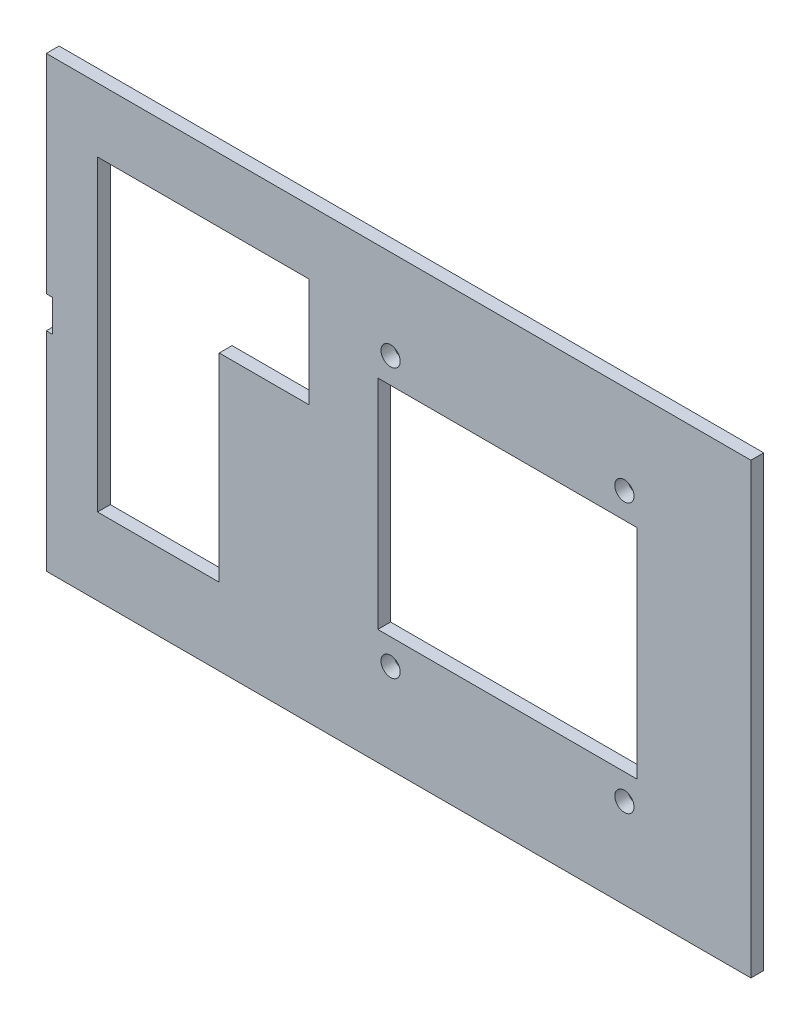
ISO-10303-21;
HEADER;
FILE_DESCRIPTION(('STEP AP214'),'2;1');
FILE_NAME('part.step','',(''),(''),'','','');
FILE_SCHEMA(('AUTOMOTIVE_DESIGN { 1 0 10303 214 1 1 1 1 }'));
ENDSEC;
DATA;
#1=APPLICATION_CONTEXT('core data for automotive mechanical design processes');
#2=APPLICATION_PROTOCOL_DEFINITION('international standard','automotive_design',2000,#1);
#3=PRODUCT_CONTEXT('',#1,'mechanical');
#4=PRODUCT('Part','Part','',(#3));
#5=PRODUCT_RELATED_PRODUCT_CATEGORY('part','',(#4));
#6=PRODUCT_DEFINITION_FORMATION('','',#4);
#7=PRODUCT_DEFINITION_CONTEXT('part definition',#1,'design');
#8=PRODUCT_DEFINITION('design','',#6,#7);
#9=PRODUCT_DEFINITION_SHAPE('','',#8);
#10=(LENGTH_UNIT() NAMED_UNIT(*) SI_UNIT(.MILLI.,.METRE.));
#11=(NAMED_UNIT(*) PLANE_ANGLE_UNIT() SI_UNIT($,.RADIAN.));
#12=(NAMED_UNIT(*) SI_UNIT($,.STERADIAN.) SOLID_ANGLE_UNIT());
#13=UNCERTAINTY_MEASURE_WITH_UNIT(LENGTH_MEASURE(1.E-05),#10,'distance_accuracy_value','');
#14=(GEOMETRIC_REPRESENTATION_CONTEXT(3) GLOBAL_UNCERTAINTY_ASSIGNED_CONTEXT((#13)) GLOBAL_UNIT_ASSIGNED_CONTEXT((#10,
#11,#12)) REPRESENTATION_CONTEXT('',''));
#15=CARTESIAN_POINT('',(0.,0.,0.));
#16=DIRECTION('',(0.,0.,1.));
#17=DIRECTION('',(1.,0.,0.));
#18=AXIS2_PLACEMENT_3D('',#15,#16,#17);
#19=CARTESIAN_POINT('',(0.,0.,2.));
#20=DIRECTION('',(0.,0.,1.));
#21=DIRECTION('',(1.,0.,0.));
#22=AXIS2_PLACEMENT_3D('',#19,#20,#21);
#23=PLANE('',#22);
#24=DIRECTION('',(0.,-1.,0.));
#25=VECTOR('',#24,1.);
#26=CARTESIAN_POINT('',(-47.,0.,2.));
#27=LINE('',#26,#25);
#28=CARTESIAN_POINT('',(-47.,25.,2.));
#29=VERTEX_POINT('',#28);
#30=CARTESIAN_POINT('',(-47.,-23.,2.));
#31=VERTEX_POINT('',#30);
#32=EDGE_CURVE('E186',#29,#31,#27,.T.);
#33=ORIENTED_EDGE('',*,*,#32,.F.);
#34=DIRECTION('',(-1.,0.,0.));
#35=VECTOR('',#34,1.);
#36=CARTESIAN_POINT('',(0.,25.,2.));
#37=LINE('',#36,#35);
#38=CARTESIAN_POINT('',(-14.,25.,2.));
#39=VERTEX_POINT('',#38);
#40=EDGE_CURVE('E184',#39,#29,#37,.T.);
#41=ORIENTED_EDGE('',*,*,#40,.F.);
#42=DIRECTION('',(0.,-1.,0.));
#43=VECTOR('',#42,1.);
#44=CARTESIAN_POINT('',(-14.,0.,2.));
#45=LINE('',#44,#43);
#46=CARTESIAN_POINT('',(-14.,7.99999999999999,2.));
#47=VERTEX_POINT('',#46);
#48=EDGE_CURVE('E179',#39,#47,#45,.T.);
#49=ORIENTED_EDGE('',*,*,#48,.T.);
#50=DIRECTION('',(-1.,0.,0.));
#51=VECTOR('',#50,1.);
#52=CARTESIAN_POINT('',(0.,7.99999999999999,2.));
#53=LINE('',#52,#51);
#54=CARTESIAN_POINT('',(-28.,7.99999999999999,2.));
#55=VERTEX_POINT('',#54);
#56=EDGE_CURVE('E177',#47,#55,#53,.T.);
#57=ORIENTED_EDGE('',*,*,#56,.T.);
#58=DIRECTION('',(0.,-1.,0.));
#59=VECTOR('',#58,1.);
#60=CARTESIAN_POINT('',(-28.,0.,2.));
#61=LINE('',#60,#59);
#62=CARTESIAN_POINT('',(-28.,-23.,2.));
#63=VERTEX_POINT('',#62);
#64=EDGE_CURVE('E162',#55,#63,#61,.T.);
#65=ORIENTED_EDGE('',*,*,#64,.T.);
#66=DIRECTION('',(-1.,0.,0.));
#67=VECTOR('',#66,1.);
#68=CARTESIAN_POINT('',(0.,-23.,2.));
#69=LINE('',#68,#67);
#70=EDGE_CURVE('E157',#63,#31,#69,.T.);
#71=ORIENTED_EDGE('',*,*,#70,.T.);
#72=EDGE_LOOP('',(#33,#41,#49,#57,#65,#71));
#73=FACE_BOUND('',#72,.T.);
#74=CARTESIAN_POINT('',(-1.25000000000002,21.,2.));
#75=DIRECTION('',(0.,0.,1.));
#76=DIRECTION('',(1.,0.,0.));
#77=AXIS2_PLACEMENT_3D('',#74,#75,#76);
#78=CIRCLE('',#77,1.5);
#79=CARTESIAN_POINT('',(0.249999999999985,21.,2.));
#80=VERTEX_POINT('',#79);
#81=EDGE_CURVE('E197',#80,#80,#78,.F.);
#82=ORIENTED_EDGE('',*,*,#81,.T.);
#83=EDGE_LOOP('',(#82));
#84=FACE_BOUND('',#83,.T.);
#85=CARTESIAN_POINT('',(35.25,-21.,2.));
#86=DIRECTION('',(0.,0.,1.));
#87=DIRECTION('',(1.,0.,0.));
#88=AXIS2_PLACEMENT_3D('',#85,#86,#87);
#89=CIRCLE('',#88,1.5);
#90=CARTESIAN_POINT('',(36.75,-21.,2.));
#91=VERTEX_POINT('',#90);
#92=EDGE_CURVE('E193',#91,#91,#89,.F.);
#93=ORIENTED_EDGE('',*,*,#92,.T.);
#94=EDGE_LOOP('',(#93));
#95=FACE_BOUND('',#94,.T.);
#96=CARTESIAN_POINT('',(-1.25000000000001,-21.,2.));
#97=DIRECTION('',(0.,0.,1.));
#98=DIRECTION('',(1.,0.,0.));
#99=AXIS2_PLACEMENT_3D('',#96,#97,#98);
#100=CIRCLE('',#99,1.5);
#101=CARTESIAN_POINT('',(0.249999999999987,-21.,2.));
#102=VERTEX_POINT('',#101);
#103=EDGE_CURVE('E189',#102,#102,#100,.F.);
#104=ORIENTED_EDGE('',*,*,#103,.T.);
#105=EDGE_LOOP('',(#104));
#106=FACE_BOUND('',#105,.T.);
#107=CARTESIAN_POINT('',(35.25,21.,2.));
#108=DIRECTION('',(0.,0.,1.));
#109=DIRECTION('',(1.,0.,0.));
#110=AXIS2_PLACEMENT_3D('',#107,#108,#109);
#111=CIRCLE('',#110,1.5);
#112=CARTESIAN_POINT('',(36.75,21.,2.));
#113=VERTEX_POINT('',#112);
#114=EDGE_CURVE('E201',#113,#113,#111,.F.);
#115=ORIENTED_EDGE('',*,*,#114,.T.);
#116=EDGE_LOOP('',(#115));
#117=FACE_BOUND('',#116,.T.);
#118=DIRECTION('',(0.,-1.,0.));
#119=VECTOR('',#118,1.);
#120=CARTESIAN_POINT('',(-55.,35.,2.));
#121=LINE('',#120,#119);
#122=CARTESIAN_POINT('',(-55.,35.,2.));
#123=VERTEX_POINT('',#122);
#124=CARTESIAN_POINT('',(-55.,2.5,2.));
#125=VERTEX_POINT('',#124);
#126=EDGE_CURVE('E253',#123,#125,#121,.T.);
#127=ORIENTED_EDGE('',*,*,#126,.T.);
#128=DIRECTION('',(1.,0.,0.));
#129=VECTOR('',#128,1.);
#130=CARTESIAN_POINT('',(0.,2.5,2.));
#131=LINE('',#130,#129);
#132=CARTESIAN_POINT('',(-54.,2.5,2.));
#133=VERTEX_POINT('',#132);
#134=EDGE_CURVE('E239',#125,#133,#131,.T.);
#135=ORIENTED_EDGE('',*,*,#134,.T.);
#136=DIRECTION('',(0.,-1.,0.));
#137=VECTOR('',#136,1.);
#138=CARTESIAN_POINT('',(-54.,0.,2.));
#139=LINE('',#138,#137);
#140=CARTESIAN_POINT('',(-54.,-2.5,2.));
#141=VERTEX_POINT('',#140);
#142=EDGE_CURVE('E242',#133,#141,#139,.T.);
#143=ORIENTED_EDGE('',*,*,#142,.T.);
#144=DIRECTION('',(-1.,0.,0.));
#145=VECTOR('',#144,1.);
#146=CARTESIAN_POINT('',(0.,-2.5,2.));
#147=LINE('',#146,#145);
#148=CARTESIAN_POINT('',(-55.,-2.5,2.));
#149=VERTEX_POINT('',#148);
#150=EDGE_CURVE('E234',#141,#149,#147,.T.);
#151=ORIENTED_EDGE('',*,*,#150,.T.);
#152=CARTESIAN_POINT('',(-55.,-35.,2.));
#153=VERTEX_POINT('',#152);
#154=EDGE_CURVE('E252',#149,#153,#121,.T.);
#155=ORIENTED_EDGE('',*,*,#154,.T.);
#156=DIRECTION('',(1.,0.,0.));
#157=VECTOR('',#156,1.);
#158=CARTESIAN_POINT('',(-55.,-35.,2.));
#159=LINE('',#158,#157);
#160=CARTESIAN_POINT('',(55.,-35.,2.));
#161=VERTEX_POINT('',#160);
#162=EDGE_CURVE('E256',#153,#161,#159,.T.);
#163=ORIENTED_EDGE('',*,*,#162,.T.);
#164=DIRECTION('',(0.,1.,0.));
#165=VECTOR('',#164,1.);
#166=CARTESIAN_POINT('',(55.,35.,2.));
#167=LINE('',#166,#165);
#168=CARTESIAN_POINT('',(55.,35.,2.));
#169=VERTEX_POINT('',#168);
#170=EDGE_CURVE('E246',#161,#169,#167,.T.);
#171=ORIENTED_EDGE('',*,*,#170,.T.);
#172=DIRECTION('',(-1.,0.,0.));
#173=VECTOR('',#172,1.);
#174=CARTESIAN_POINT('',(-55.,35.,2.));
#175=LINE('',#174,#173);
#176=EDGE_CURVE('E249',#169,#123,#175,.T.);
#177=ORIENTED_EDGE('',*,*,#176,.T.);
#178=EDGE_LOOP('',(#127,#135,#143,#151,#155,#163,#171,#177));
#179=FACE_BOUND('',#178,.T.);
#180=DIRECTION('',(1.,0.,0.));
#181=VECTOR('',#180,1.);
#182=CARTESIAN_POINT('',(0.,17.,2.));
#183=LINE('',#182,#181);
#184=CARTESIAN_POINT('',(-3.25000000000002,17.,2.));
#185=VERTEX_POINT('',#184);
#186=CARTESIAN_POINT('',(37.25,17.,2.));
#187=VERTEX_POINT('',#186);
#188=EDGE_CURVE('E221',#185,#187,#183,.T.);
#189=ORIENTED_EDGE('',*,*,#188,.T.);
#190=DIRECTION('',(0.,-1.,0.));
#191=VECTOR('',#190,1.);
#192=CARTESIAN_POINT('',(37.25,0.,2.));
#193=LINE('',#192,#191);
#194=CARTESIAN_POINT('',(37.25,-17.,2.));
#195=VERTEX_POINT('',#194);
#196=EDGE_CURVE('E224',#187,#195,#193,.T.);
#197=ORIENTED_EDGE('',*,*,#196,.T.);
#198=DIRECTION('',(-1.,0.,0.));
#199=VECTOR('',#198,1.);
#200=CARTESIAN_POINT('',(0.,-17.,2.));
#201=LINE('',#200,#199);
#202=CARTESIAN_POINT('',(-3.25000000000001,-17.,2.));
#203=VERTEX_POINT('',#202);
#204=EDGE_CURVE('E215',#195,#203,#201,.T.);
#205=ORIENTED_EDGE('',*,*,#204,.T.);
#206=DIRECTION('',(0.,1.,0.));
#207=VECTOR('',#206,1.);
#208=CARTESIAN_POINT('',(-3.25000000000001,0.,2.));
#209=LINE('',#208,#207);
#210=EDGE_CURVE('E218',#203,#185,#209,.T.);
#211=ORIENTED_EDGE('',*,*,#210,.T.);
#212=EDGE_LOOP('',(#189,#197,#205,#211));
#213=FACE_BOUND('',#212,.T.);
#214=ADVANCED_FACE('F35',(#73,#84,#95,#106,#117,#179,#213),#23,.T.);
#215=CARTESIAN_POINT('',(0.,0.,0.));
#216=DIRECTION('',(0.,0.,1.));
#217=DIRECTION('',(1.,0.,0.));
#218=AXIS2_PLACEMENT_3D('',#215,#216,#217);
#219=PLANE('',#218);
#220=DIRECTION('',(-1.,0.,0.));
#221=VECTOR('',#220,1.);
#222=CARTESIAN_POINT('',(0.,25.,0.));
#223=LINE('',#222,#221);
#224=CARTESIAN_POINT('',(-14.,25.,0.));
#225=VERTEX_POINT('',#224);
#226=CARTESIAN_POINT('',(-47.,25.,0.));
#227=VERTEX_POINT('',#226);
#228=EDGE_CURVE('E43',#225,#227,#223,.T.);
#229=ORIENTED_EDGE('',*,*,#228,.T.);
#230=DIRECTION('',(0.,-1.,0.));
#231=VECTOR('',#230,1.);
#232=CARTESIAN_POINT('',(-47.,0.,0.));
#233=LINE('',#232,#231);
#234=CARTESIAN_POINT('',(-47.,-23.,0.));
#235=VERTEX_POINT('',#234);
#236=EDGE_CURVE('E11',#227,#235,#233,.T.);
#237=ORIENTED_EDGE('',*,*,#236,.T.);
#238=DIRECTION('',(-1.,0.,0.));
#239=VECTOR('',#238,1.);
#240=CARTESIAN_POINT('',(0.,-23.,0.));
#241=LINE('',#240,#239);
#242=CARTESIAN_POINT('',(-28.,-23.,0.));
#243=VERTEX_POINT('',#242);
#244=EDGE_CURVE('E295',#243,#235,#241,.T.);
#245=ORIENTED_EDGE('',*,*,#244,.F.);
#246=DIRECTION('',(0.,-1.,0.));
#247=VECTOR('',#246,1.);
#248=CARTESIAN_POINT('',(-28.,0.,0.));
#249=LINE('',#248,#247);
#250=CARTESIAN_POINT('',(-28.,7.99999999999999,0.));
#251=VERTEX_POINT('',#250);
#252=EDGE_CURVE('E170',#251,#243,#249,.T.);
#253=ORIENTED_EDGE('',*,*,#252,.F.);
#254=DIRECTION('',(-1.,0.,0.));
#255=VECTOR('',#254,1.);
#256=CARTESIAN_POINT('',(0.,7.99999999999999,0.));
#257=LINE('',#256,#255);
#258=CARTESIAN_POINT('',(-14.,7.99999999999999,0.));
#259=VERTEX_POINT('',#258);
#260=EDGE_CURVE('E306',#259,#251,#257,.T.);
#261=ORIENTED_EDGE('',*,*,#260,.F.);
#262=DIRECTION('',(0.,-1.,0.));
#263=VECTOR('',#262,1.);
#264=CARTESIAN_POINT('',(-14.,0.,0.));
#265=LINE('',#264,#263);
#266=EDGE_CURVE('E308',#225,#259,#265,.T.);
#267=ORIENTED_EDGE('',*,*,#266,.F.);
#268=EDGE_LOOP('',(#229,#237,#245,#253,#261,#267));
#269=FACE_BOUND('',#268,.T.);
#270=CARTESIAN_POINT('',(-1.25000000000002,21.,0.));
#271=DIRECTION('',(0.,0.,1.));
#272=DIRECTION('',(1.,0.,0.));
#273=AXIS2_PLACEMENT_3D('',#270,#271,#272);
#274=CIRCLE('',#273,1.5);
#275=CARTESIAN_POINT('',(0.249999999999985,21.,0.));
#276=VERTEX_POINT('',#275);
#277=EDGE_CURVE('E196',#276,#276,#274,.F.);
#278=ORIENTED_EDGE('',*,*,#277,.F.);
#279=EDGE_LOOP('',(#278));
#280=FACE_BOUND('',#279,.T.);
#281=CARTESIAN_POINT('',(35.25,-21.,0.));
#282=DIRECTION('',(0.,0.,1.));
#283=DIRECTION('',(1.,0.,0.));
#284=AXIS2_PLACEMENT_3D('',#281,#282,#283);
#285=CIRCLE('',#284,1.5);
#286=CARTESIAN_POINT('',(36.75,-21.,0.));
#287=VERTEX_POINT('',#286);
#288=EDGE_CURVE('E192',#287,#287,#285,.F.);
#289=ORIENTED_EDGE('',*,*,#288,.F.);
#290=EDGE_LOOP('',(#289));
#291=FACE_BOUND('',#290,.T.);
#292=CARTESIAN_POINT('',(-1.25000000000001,-21.,0.));
#293=DIRECTION('',(0.,0.,1.));
#294=DIRECTION('',(1.,0.,0.));
#295=AXIS2_PLACEMENT_3D('',#292,#293,#294);
#296=CIRCLE('',#295,1.5);
#297=CARTESIAN_POINT('',(0.249999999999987,-21.,0.));
#298=VERTEX_POINT('',#297);
#299=EDGE_CURVE('E188',#298,#298,#296,.F.);
#300=ORIENTED_EDGE('',*,*,#299,.F.);
#301=EDGE_LOOP('',(#300));
#302=FACE_BOUND('',#301,.T.);
#303=CARTESIAN_POINT('',(35.25,21.,0.));
#304=DIRECTION('',(0.,0.,1.));
#305=DIRECTION('',(1.,0.,0.));
#306=AXIS2_PLACEMENT_3D('',#303,#304,#305);
#307=CIRCLE('',#306,1.5);
#308=CARTESIAN_POINT('',(36.75,21.,0.));
#309=VERTEX_POINT('',#308);
#310=EDGE_CURVE('E200',#309,#309,#307,.F.);
#311=ORIENTED_EDGE('',*,*,#310,.F.);
#312=EDGE_LOOP('',(#311));
#313=FACE_BOUND('',#312,.T.);
#314=DIRECTION('',(1.,0.,0.));
#315=VECTOR('',#314,1.);
#316=CARTESIAN_POINT('',(0.,2.5,0.));
#317=LINE('',#316,#315);
#318=CARTESIAN_POINT('',(-55.,2.5,0.));
#319=VERTEX_POINT('',#318);
#320=CARTESIAN_POINT('',(-54.,2.5,0.));
#321=VERTEX_POINT('',#320);
#322=EDGE_CURVE('E284',#319,#321,#317,.T.);
#323=ORIENTED_EDGE('',*,*,#322,.F.);
#324=DIRECTION('',(0.,-1.,0.));
#325=VECTOR('',#324,1.);
#326=CARTESIAN_POINT('',(-55.,35.,0.));
#327=LINE('',#326,#325);
#328=CARTESIAN_POINT('',(-55.,35.,0.));
#329=VERTEX_POINT('',#328);
#330=EDGE_CURVE('E264',#329,#319,#327,.T.);
#331=ORIENTED_EDGE('',*,*,#330,.F.);
#332=DIRECTION('',(-1.,0.,0.));
#333=VECTOR('',#332,1.);
#334=CARTESIAN_POINT('',(-55.,35.,0.));
#335=LINE('',#334,#333);
#336=CARTESIAN_POINT('',(55.,35.,0.));
#337=VERTEX_POINT('',#336);
#338=EDGE_CURVE('E261',#337,#329,#335,.T.);
#339=ORIENTED_EDGE('',*,*,#338,.F.);
#340=DIRECTION('',(0.,1.,0.));
#341=VECTOR('',#340,1.);
#342=CARTESIAN_POINT('',(55.,35.,0.));
#343=LINE('',#342,#341);
#344=CARTESIAN_POINT('',(55.,-35.,0.));
#345=VERTEX_POINT('',#344);
#346=EDGE_CURVE('E245',#345,#337,#343,.T.);
#347=ORIENTED_EDGE('',*,*,#346,.F.);
#348=DIRECTION('',(1.,0.,0.));
#349=VECTOR('',#348,1.);
#350=CARTESIAN_POINT('',(-55.,-35.,0.));
#351=LINE('',#350,#349);
#352=CARTESIAN_POINT('',(-55.,-35.,0.));
#353=VERTEX_POINT('',#352);
#354=EDGE_CURVE('E250',#353,#345,#351,.T.);
#355=ORIENTED_EDGE('',*,*,#354,.F.);
#356=CARTESIAN_POINT('',(-55.,-2.5,0.));
#357=VERTEX_POINT('',#356);
#358=EDGE_CURVE('E263',#357,#353,#327,.T.);
#359=ORIENTED_EDGE('',*,*,#358,.F.);
#360=DIRECTION('',(-1.,0.,0.));
#361=VECTOR('',#360,1.);
#362=CARTESIAN_POINT('',(0.,-2.5,0.));
#363=LINE('',#362,#361);
#364=CARTESIAN_POINT('',(-54.,-2.5,0.));
#365=VERTEX_POINT('',#364);
#366=EDGE_CURVE('E279',#365,#357,#363,.T.);
#367=ORIENTED_EDGE('',*,*,#366,.F.);
#368=DIRECTION('',(0.,-1.,0.));
#369=VECTOR('',#368,1.);
#370=CARTESIAN_POINT('',(-54.,0.,0.));
#371=LINE('',#370,#369);
#372=EDGE_CURVE('E281',#321,#365,#371,.T.);
#373=ORIENTED_EDGE('',*,*,#372,.F.);
#374=EDGE_LOOP('',(#323,#331,#339,#347,#355,#359,#367,#373));
#375=FACE_BOUND('',#374,.T.);
#376=DIRECTION('',(0.,-1.,0.));
#377=VECTOR('',#376,1.);
#378=CARTESIAN_POINT('',(37.25,0.,0.));
#379=LINE('',#378,#377);
#380=CARTESIAN_POINT('',(37.25,17.,0.));
#381=VERTEX_POINT('',#380);
#382=CARTESIAN_POINT('',(37.25,-17.,0.));
#383=VERTEX_POINT('',#382);
#384=EDGE_CURVE('E292',#381,#383,#379,.T.);
#385=ORIENTED_EDGE('',*,*,#384,.F.);
#386=DIRECTION('',(1.,0.,0.));
#387=VECTOR('',#386,1.);
#388=CARTESIAN_POINT('',(0.,17.,0.));
#389=LINE('',#388,#387);
#390=CARTESIAN_POINT('',(-3.25000000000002,17.,0.));
#391=VERTEX_POINT('',#390);
#392=EDGE_CURVE('E290',#391,#381,#389,.T.);
#393=ORIENTED_EDGE('',*,*,#392,.F.);
#394=DIRECTION('',(0.,1.,0.));
#395=VECTOR('',#394,1.);
#396=CARTESIAN_POINT('',(-3.25000000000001,0.,0.));
#397=LINE('',#396,#395);
#398=CARTESIAN_POINT('',(-3.25000000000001,-17.,0.));
#399=VERTEX_POINT('',#398);
#400=EDGE_CURVE('E288',#399,#391,#397,.T.);
#401=ORIENTED_EDGE('',*,*,#400,.F.);
#402=DIRECTION('',(-1.,0.,0.));
#403=VECTOR('',#402,1.);
#404=CARTESIAN_POINT('',(0.,-17.,0.));
#405=LINE('',#404,#403);
#406=EDGE_CURVE('E286',#383,#399,#405,.T.);
#407=ORIENTED_EDGE('',*,*,#406,.F.);
#408=EDGE_LOOP('',(#385,#393,#401,#407));
#409=FACE_BOUND('',#408,.T.);
#410=ADVANCED_FACE('F312',(#269,#280,#291,#302,#313,#375,#409),#219,.F.);
#411=CARTESIAN_POINT('',(-55.,35.,2.));
#412=DIRECTION('',(1.,0.,0.));
#413=DIRECTION('',(0.,0.,-1.));
#414=AXIS2_PLACEMENT_3D('',#411,#412,#413);
#415=PLANE('',#414);
#416=DIRECTION('',(0.,0.,-1.));
#417=VECTOR('',#416,1.);
#418=CARTESIAN_POINT('',(-55.,2.5,2.));
#419=LINE('',#418,#417);
#420=EDGE_CURVE('E237',#125,#319,#419,.T.);
#421=ORIENTED_EDGE('',*,*,#420,.F.);
#422=ORIENTED_EDGE('',*,*,#126,.F.);
#423=DIRECTION('',(0.,0.,-1.));
#424=VECTOR('',#423,1.);
#425=CARTESIAN_POINT('',(-55.,35.,2.));
#426=LINE('',#425,#424);
#427=EDGE_CURVE('E273',#123,#329,#426,.T.);
#428=ORIENTED_EDGE('',*,*,#427,.T.);
#429=ORIENTED_EDGE('',*,*,#330,.T.);
#430=EDGE_LOOP('',(#421,#422,#428,#429));
#431=FACE_BOUND('',#430,.T.);
#432=ADVANCED_FACE('F352',(#431),#415,.F.);
#433=DIRECTION('',(0.,0.,1.));
#434=VECTOR('',#433,1.);
#435=CARTESIAN_POINT('',(-55.,-2.5,2.));
#436=LINE('',#435,#434);
#437=EDGE_CURVE('E232',#357,#149,#436,.T.);
#438=ORIENTED_EDGE('',*,*,#437,.F.);
#439=ORIENTED_EDGE('',*,*,#358,.T.);
#440=DIRECTION('',(0.,0.,-1.));
#441=VECTOR('',#440,1.);
#442=CARTESIAN_POINT('',(-55.,-35.,2.));
#443=LINE('',#442,#441);
#444=EDGE_CURVE('E270',#153,#353,#443,.T.);
#445=ORIENTED_EDGE('',*,*,#444,.F.);
#446=ORIENTED_EDGE('',*,*,#154,.F.);
#447=EDGE_LOOP('',(#438,#439,#445,#446));
#448=FACE_BOUND('',#447,.T.);
#449=ADVANCED_FACE('F364',(#448),#415,.F.);
#450=CARTESIAN_POINT('',(55.,35.,2.));
#451=DIRECTION('',(-1.,0.,0.));
#452=DIRECTION('',(0.,0.,1.));
#453=AXIS2_PLACEMENT_3D('',#450,#451,#452);
#454=PLANE('',#453);
#455=ORIENTED_EDGE('',*,*,#346,.T.);
#456=DIRECTION('',(0.,0.,-1.));
#457=VECTOR('',#456,1.);
#458=CARTESIAN_POINT('',(55.,35.,2.));
#459=LINE('',#458,#457);
#460=EDGE_CURVE('E276',#169,#337,#459,.T.);
#461=ORIENTED_EDGE('',*,*,#460,.F.);
#462=ORIENTED_EDGE('',*,*,#170,.F.);
#463=DIRECTION('',(0.,0.,-1.));
#464=VECTOR('',#463,1.);
#465=CARTESIAN_POINT('',(55.,-35.,2.));
#466=LINE('',#465,#464);
#467=EDGE_CURVE('E258',#161,#345,#466,.T.);
#468=ORIENTED_EDGE('',*,*,#467,.T.);
#469=EDGE_LOOP('',(#455,#461,#462,#468));
#470=FACE_BOUND('',#469,.T.);
#471=ADVANCED_FACE('F37',(#470),#454,.F.);
#472=CARTESIAN_POINT('',(-55.,35.,2.));
#473=DIRECTION('',(0.,-1.,0.));
#474=DIRECTION('',(0.,0.,-1.));
#475=AXIS2_PLACEMENT_3D('',#472,#473,#474);
#476=PLANE('',#475);
#477=ORIENTED_EDGE('',*,*,#338,.T.);
#478=ORIENTED_EDGE('',*,*,#427,.F.);
#479=ORIENTED_EDGE('',*,*,#176,.F.);
#480=ORIENTED_EDGE('',*,*,#460,.T.);
#481=EDGE_LOOP('',(#477,#478,#479,#480));
#482=FACE_BOUND('',#481,.T.);
#483=ADVANCED_FACE('F361',(#482),#476,.F.);
#484=CARTESIAN_POINT('',(-55.,-35.,2.));
#485=DIRECTION('',(0.,1.,0.));
#486=DIRECTION('',(0.,0.,1.));
#487=AXIS2_PLACEMENT_3D('',#484,#485,#486);
#488=PLANE('',#487);
#489=ORIENTED_EDGE('',*,*,#354,.T.);
#490=ORIENTED_EDGE('',*,*,#467,.F.);
#491=ORIENTED_EDGE('',*,*,#162,.F.);
#492=ORIENTED_EDGE('',*,*,#444,.T.);
#493=EDGE_LOOP('',(#489,#490,#491,#492));
#494=FACE_BOUND('',#493,.T.);
#495=ADVANCED_FACE('F358',(#494),#488,.F.);
#496=CARTESIAN_POINT('',(-54.,2.5,17.));
#497=DIRECTION('',(-1.,0.,0.));
#498=DIRECTION('',(0.,0.,1.));
#499=AXIS2_PLACEMENT_3D('',#496,#497,#498);
#500=PLANE('',#499);
#501=DIRECTION('',(0.,0.,-1.));
#502=VECTOR('',#501,1.);
#503=CARTESIAN_POINT('',(-54.,2.5,17.));
#504=LINE('',#503,#502);
#505=EDGE_CURVE('E229',#133,#321,#504,.T.);
#506=ORIENTED_EDGE('',*,*,#505,.T.);
#507=ORIENTED_EDGE('',*,*,#372,.T.);
#508=DIRECTION('',(0.,0.,-1.));
#509=VECTOR('',#508,1.);
#510=CARTESIAN_POINT('',(-54.,-2.5,17.));
#511=LINE('',#510,#509);
#512=EDGE_CURVE('E227',#141,#365,#511,.T.);
#513=ORIENTED_EDGE('',*,*,#512,.F.);
#514=ORIENTED_EDGE('',*,*,#142,.F.);
#515=EDGE_LOOP('',(#506,#507,#513,#514));
#516=FACE_BOUND('',#515,.T.);
#517=ADVANCED_FACE('F355',(#516),#500,.T.);
#518=CARTESIAN_POINT('',(-56.,2.5,17.));
#519=DIRECTION('',(0.,-1.,0.));
#520=DIRECTION('',(0.,0.,-1.));
#521=AXIS2_PLACEMENT_3D('',#518,#519,#520);
#522=PLANE('',#521);
#523=ORIENTED_EDGE('',*,*,#420,.T.);
#524=ORIENTED_EDGE('',*,*,#322,.T.);
#525=ORIENTED_EDGE('',*,*,#505,.F.);
#526=ORIENTED_EDGE('',*,*,#134,.F.);
#527=EDGE_LOOP('',(#523,#524,#525,#526));
#528=FACE_BOUND('',#527,.T.);
#529=ADVANCED_FACE('F385',(#528),#522,.T.);
#530=CARTESIAN_POINT('',(-56.,-2.5,17.));
#531=DIRECTION('',(0.,1.,0.));
#532=DIRECTION('',(0.,0.,1.));
#533=AXIS2_PLACEMENT_3D('',#530,#531,#532);
#534=PLANE('',#533);
#535=ORIENTED_EDGE('',*,*,#512,.T.);
#536=ORIENTED_EDGE('',*,*,#366,.T.);
#537=ORIENTED_EDGE('',*,*,#437,.T.);
#538=ORIENTED_EDGE('',*,*,#150,.F.);
#539=EDGE_LOOP('',(#535,#536,#537,#538));
#540=FACE_BOUND('',#539,.T.);
#541=ADVANCED_FACE('F400',(#540),#534,.T.);
#542=CARTESIAN_POINT('',(37.25,17.,12.));
#543=DIRECTION('',(-1.,0.,0.));
#544=DIRECTION('',(0.,0.,1.));
#545=AXIS2_PLACEMENT_3D('',#542,#543,#544);
#546=PLANE('',#545);
#547=DIRECTION('',(0.,0.,-1.));
#548=VECTOR('',#547,1.);
#549=CARTESIAN_POINT('',(37.25,17.,12.));
#550=LINE('',#549,#548);
#551=EDGE_CURVE('E212',#187,#381,#550,.T.);
#552=ORIENTED_EDGE('',*,*,#551,.T.);
#553=ORIENTED_EDGE('',*,*,#384,.T.);
#554=DIRECTION('',(0.,0.,-1.));
#555=VECTOR('',#554,1.);
#556=CARTESIAN_POINT('',(37.25,-17.,12.));
#557=LINE('',#556,#555);
#558=EDGE_CURVE('E204',#195,#383,#557,.T.);
#559=ORIENTED_EDGE('',*,*,#558,.F.);
#560=ORIENTED_EDGE('',*,*,#196,.F.);
#561=EDGE_LOOP('',(#552,#553,#559,#560));
#562=FACE_BOUND('',#561,.T.);
#563=ADVANCED_FACE('F402',(#562),#546,.T.);
#564=CARTESIAN_POINT('',(-3.25000000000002,17.,12.));
#565=DIRECTION('',(0.,-1.,0.));
#566=DIRECTION('',(0.,0.,-1.));
#567=AXIS2_PLACEMENT_3D('',#564,#565,#566);
#568=PLANE('',#567);
#569=DIRECTION('',(0.,0.,-1.));
#570=VECTOR('',#569,1.);
#571=CARTESIAN_POINT('',(-3.25000000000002,17.,12.));
#572=LINE('',#571,#570);
#573=EDGE_CURVE('E209',#185,#391,#572,.T.);
#574=ORIENTED_EDGE('',*,*,#573,.T.);
#575=ORIENTED_EDGE('',*,*,#392,.T.);
#576=ORIENTED_EDGE('',*,*,#551,.F.);
#577=ORIENTED_EDGE('',*,*,#188,.F.);
#578=EDGE_LOOP('',(#574,#575,#576,#577));
#579=FACE_BOUND('',#578,.T.);
#580=ADVANCED_FACE('F408',(#579),#568,.T.);
#581=CARTESIAN_POINT('',(-3.25000000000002,17.,12.));
#582=DIRECTION('',(1.,0.,0.));
#583=DIRECTION('',(0.,1.,0.));
#584=AXIS2_PLACEMENT_3D('',#581,#582,#583);
#585=PLANE('',#584);
#586=DIRECTION('',(0.,0.,-1.));
#587=VECTOR('',#586,1.);
#588=CARTESIAN_POINT('',(-3.25000000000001,-17.,12.));
#589=LINE('',#588,#587);
#590=EDGE_CURVE('E206',#203,#399,#589,.T.);
#591=ORIENTED_EDGE('',*,*,#590,.T.);
#592=ORIENTED_EDGE('',*,*,#400,.T.);
#593=ORIENTED_EDGE('',*,*,#573,.F.);
#594=ORIENTED_EDGE('',*,*,#210,.F.);
#595=EDGE_LOOP('',(#591,#592,#593,#594));
#596=FACE_BOUND('',#595,.T.);
#597=ADVANCED_FACE('F414',(#596),#585,.T.);
#598=CARTESIAN_POINT('',(-3.25000000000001,-17.,12.));
#599=DIRECTION('',(0.,1.,0.));
#600=DIRECTION('',(0.,0.,1.));
#601=AXIS2_PLACEMENT_3D('',#598,#599,#600);
#602=PLANE('',#601);
#603=ORIENTED_EDGE('',*,*,#558,.T.);
#604=ORIENTED_EDGE('',*,*,#406,.T.);
#605=ORIENTED_EDGE('',*,*,#590,.F.);
#606=ORIENTED_EDGE('',*,*,#204,.F.);
#607=EDGE_LOOP('',(#603,#604,#605,#606));
#608=FACE_BOUND('',#607,.T.);
#609=ADVANCED_FACE('F418',(#608),#602,.T.);
#610=CARTESIAN_POINT('',(35.25,21.,-10.));
#611=DIRECTION('',(0.,0.,1.));
#612=DIRECTION('',(1.,0.,0.));
#613=AXIS2_PLACEMENT_3D('',#610,#611,#612);
#614=CYLINDRICAL_SURFACE('',#613,1.5);
#615=ORIENTED_EDGE('',*,*,#114,.F.);
#616=EDGE_LOOP('',(#615));
#617=FACE_BOUND('',#616,.T.);
#618=ORIENTED_EDGE('',*,*,#310,.T.);
#619=EDGE_LOOP('',(#618));
#620=FACE_BOUND('',#619,.T.);
#621=ADVANCED_FACE('F422',(#617,#620),#614,.F.);
#622=CARTESIAN_POINT('',(-1.25000000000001,-21.,-10.));
#623=DIRECTION('',(0.,0.,1.));
#624=DIRECTION('',(1.,0.,0.));
#625=AXIS2_PLACEMENT_3D('',#622,#623,#624);
#626=CYLINDRICAL_SURFACE('',#625,1.5);
#627=ORIENTED_EDGE('',*,*,#103,.F.);
#628=EDGE_LOOP('',(#627));
#629=FACE_BOUND('',#628,.T.);
#630=ORIENTED_EDGE('',*,*,#299,.T.);
#631=EDGE_LOOP('',(#630));
#632=FACE_BOUND('',#631,.T.);
#633=ADVANCED_FACE('F426',(#629,#632),#626,.F.);
#634=CARTESIAN_POINT('',(35.25,-21.,-10.));
#635=DIRECTION('',(0.,0.,1.));
#636=DIRECTION('',(1.,0.,0.));
#637=AXIS2_PLACEMENT_3D('',#634,#635,#636);
#638=CYLINDRICAL_SURFACE('',#637,1.5);
#639=ORIENTED_EDGE('',*,*,#92,.F.);
#640=EDGE_LOOP('',(#639));
#641=FACE_BOUND('',#640,.T.);
#642=ORIENTED_EDGE('',*,*,#288,.T.);
#643=EDGE_LOOP('',(#642));
#644=FACE_BOUND('',#643,.T.);
#645=ADVANCED_FACE('F344',(#641,#644),#638,.F.);
#646=CARTESIAN_POINT('',(-1.25000000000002,21.,-10.));
#647=DIRECTION('',(0.,0.,1.));
#648=DIRECTION('',(1.,0.,0.));
#649=AXIS2_PLACEMENT_3D('',#646,#647,#648);
#650=CYLINDRICAL_SURFACE('',#649,1.5);
#651=ORIENTED_EDGE('',*,*,#81,.F.);
#652=EDGE_LOOP('',(#651));
#653=FACE_BOUND('',#652,.T.);
#654=ORIENTED_EDGE('',*,*,#277,.T.);
#655=EDGE_LOOP('',(#654));
#656=FACE_BOUND('',#655,.T.);
#657=ADVANCED_FACE('F337',(#653,#656),#650,.F.);
#658=CARTESIAN_POINT('',(-47.,0.,-10.));
#659=DIRECTION('',(-1.,0.,0.));
#660=DIRECTION('',(0.,-1.,0.));
#661=AXIS2_PLACEMENT_3D('',#658,#659,#660);
#662=PLANE('',#661);
#663=ORIENTED_EDGE('',*,*,#32,.T.);
#664=DIRECTION('',(0.,0.,1.));
#665=VECTOR('',#664,1.);
#666=CARTESIAN_POINT('',(-47.,-23.,-10.));
#667=LINE('',#666,#665);
#668=EDGE_CURVE('E50',#235,#31,#667,.T.);
#669=ORIENTED_EDGE('',*,*,#668,.F.);
#670=ORIENTED_EDGE('',*,*,#236,.F.);
#671=DIRECTION('',(0.,0.,1.));
#672=VECTOR('',#671,1.);
#673=CARTESIAN_POINT('',(-47.,25.,-10.));
#674=LINE('',#673,#672);
#675=EDGE_CURVE('E163',#227,#29,#674,.T.);
#676=ORIENTED_EDGE('',*,*,#675,.T.);
#677=EDGE_LOOP('',(#663,#669,#670,#676));
#678=FACE_BOUND('',#677,.T.);
#679=ADVANCED_FACE('F335',(#678),#662,.F.);
#680=CARTESIAN_POINT('',(0.,25.,-10.));
#681=DIRECTION('',(0.,1.,0.));
#682=DIRECTION('',(0.,0.,1.));
#683=AXIS2_PLACEMENT_3D('',#680,#681,#682);
#684=PLANE('',#683);
#685=ORIENTED_EDGE('',*,*,#40,.T.);
#686=ORIENTED_EDGE('',*,*,#675,.F.);
#687=ORIENTED_EDGE('',*,*,#228,.F.);
#688=DIRECTION('',(0.,0.,1.));
#689=VECTOR('',#688,1.);
#690=CARTESIAN_POINT('',(-14.,25.,-10.));
#691=LINE('',#690,#689);
#692=EDGE_CURVE('E320',#225,#39,#691,.T.);
#693=ORIENTED_EDGE('',*,*,#692,.T.);
#694=EDGE_LOOP('',(#685,#686,#687,#693));
#695=FACE_BOUND('',#694,.T.);
#696=ADVANCED_FACE('F319',(#695),#684,.F.);
#697=CARTESIAN_POINT('',(-14.,0.,-10.));
#698=DIRECTION('',(-1.,0.,0.));
#699=DIRECTION('',(0.,-1.,0.));
#700=AXIS2_PLACEMENT_3D('',#697,#698,#699);
#701=PLANE('',#700);
#702=ORIENTED_EDGE('',*,*,#692,.F.);
#703=ORIENTED_EDGE('',*,*,#266,.T.);
#704=DIRECTION('',(0.,0.,1.));
#705=VECTOR('',#704,1.);
#706=CARTESIAN_POINT('',(-14.,7.99999999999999,-10.));
#707=LINE('',#706,#705);
#708=EDGE_CURVE('E327',#259,#47,#707,.T.);
#709=ORIENTED_EDGE('',*,*,#708,.T.);
#710=ORIENTED_EDGE('',*,*,#48,.F.);
#711=EDGE_LOOP('',(#702,#703,#709,#710));
#712=FACE_BOUND('',#711,.T.);
#713=ADVANCED_FACE('F324',(#712),#701,.T.);
#714=CARTESIAN_POINT('',(0.,7.99999999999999,-10.));
#715=DIRECTION('',(0.,1.,0.));
#716=DIRECTION('',(0.,0.,1.));
#717=AXIS2_PLACEMENT_3D('',#714,#715,#716);
#718=PLANE('',#717);
#719=ORIENTED_EDGE('',*,*,#708,.F.);
#720=ORIENTED_EDGE('',*,*,#260,.T.);
#721=DIRECTION('',(0.,0.,1.));
#722=VECTOR('',#721,1.);
#723=CARTESIAN_POINT('',(-28.,7.99999999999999,-10.));
#724=LINE('',#723,#722);
#725=EDGE_CURVE('E172',#251,#55,#724,.T.);
#726=ORIENTED_EDGE('',*,*,#725,.T.);
#727=ORIENTED_EDGE('',*,*,#56,.F.);
#728=EDGE_LOOP('',(#719,#720,#726,#727));
#729=FACE_BOUND('',#728,.T.);
#730=ADVANCED_FACE('F333',(#729),#718,.T.);
#731=CARTESIAN_POINT('',(-28.,0.,-10.));
#732=DIRECTION('',(-1.,0.,0.));
#733=DIRECTION('',(0.,-1.,0.));
#734=AXIS2_PLACEMENT_3D('',#731,#732,#733);
#735=PLANE('',#734);
#736=ORIENTED_EDGE('',*,*,#725,.F.);
#737=ORIENTED_EDGE('',*,*,#252,.T.);
#738=DIRECTION('',(0.,0.,1.));
#739=VECTOR('',#738,1.);
#740=CARTESIAN_POINT('',(-28.,-23.,-10.));
#741=LINE('',#740,#739);
#742=EDGE_CURVE('E55',#243,#63,#741,.T.);
#743=ORIENTED_EDGE('',*,*,#742,.T.);
#744=ORIENTED_EDGE('',*,*,#64,.F.);
#745=EDGE_LOOP('',(#736,#737,#743,#744));
#746=FACE_BOUND('',#745,.T.);
#747=ADVANCED_FACE('F167',(#746),#735,.T.);
#748=CARTESIAN_POINT('',(0.,-23.,-10.));
#749=DIRECTION('',(0.,1.,0.));
#750=DIRECTION('',(0.,0.,1.));
#751=AXIS2_PLACEMENT_3D('',#748,#749,#750);
#752=PLANE('',#751);
#753=ORIENTED_EDGE('',*,*,#742,.F.);
#754=ORIENTED_EDGE('',*,*,#244,.T.);
#755=ORIENTED_EDGE('',*,*,#668,.T.);
#756=ORIENTED_EDGE('',*,*,#70,.F.);
#757=EDGE_LOOP('',(#753,#754,#755,#756));
#758=FACE_BOUND('',#757,.T.);
#759=ADVANCED_FACE('F158',(#758),#752,.T.);
#760=CLOSED_SHELL('',(#214,#410,#432,#449,#471,#483,#495,#517,#529,#541,#563,#580,#597,#609,
#621,#633,#645,#657,#679,#696,#713,#730,#747,#759));
#761=MANIFOLD_SOLID_BREP('B2',#760);
#762=ADVANCED_BREP_SHAPE_REPRESENTATION('',(#18,#761),#14);
#763=SHAPE_DEFINITION_REPRESENTATION(#9,#762);
ENDSEC;
END-ISO-10303-21;
